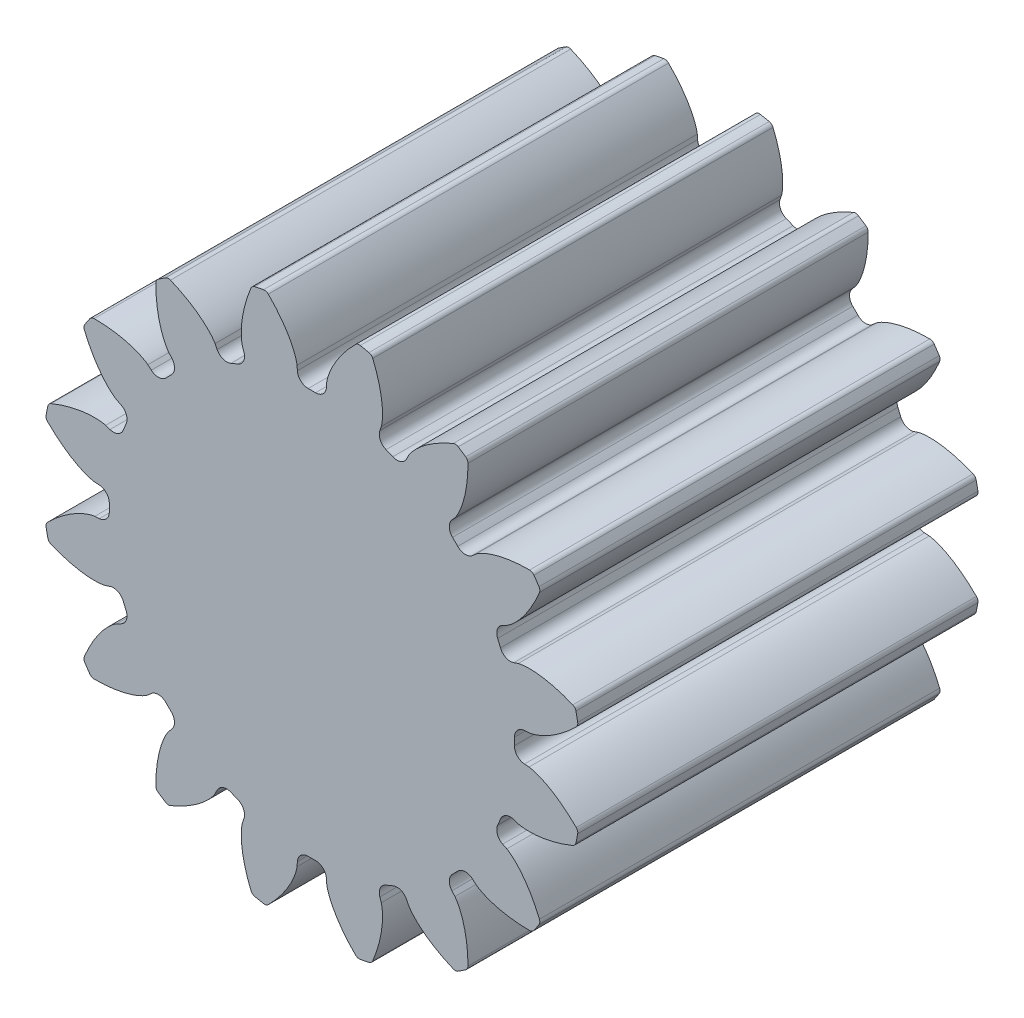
from build123d import *

# Parameters (mm, degrees)
SKETCH1_R                                 = 8.5725
BOSS_EXTRUDE1_DEPTH                       = 12.7
CUT_EXTRUDE_DCLTBC_DEPTH                  = 18.557491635
FILLET_TIP_DCLTBC_R                       = 0.169380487
FILLET_ROOT_DCLTBC_R                      = 0.338760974
CIRPATTERN_DCLTBC_COUNT                   = 16
FILLET_TIP_DCLTBC_OF_CIRPATTERN_DCLTBC_R  = 0.169380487
FILLET_ROOT_DCLTBC_OF_CIRPATTERN_DCLTBC_R = 0.338760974


with BuildPart() as part:
    # Sketch1 → Boss-Extrude1 (new body)
    with BuildSketch(Plane.XY):
        Circle(SKETCH1_R)
    extrude(amount=BOSS_EXTRUDE1_DEPTH)

    # DCLTBC → Cut-Extrude-DCLTBC (cut, through all)
    with BuildSketch(Plane.XY):
        with BuildLine():
            Line((-0.470624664, 6.890010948), (-0.438139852, 6.414428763))
            ThreePointArc((-0.438139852, 6.414428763), (0, 6.429375), (0.438139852, 6.414428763))
            Line((0.438139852, 6.414428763), (0.470624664, 6.890010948))
            add(Edge.make_bspline(
                [(0.470624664, 6.890010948), (0.4708557, 6.892762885), (0.471636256, 6.900469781), (0.473635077, 6.914990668), (0.47763725, 6.938593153), (0.483822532, 6.968514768), (0.493058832, 7.006983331), (0.505530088, 7.052006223), (0.520893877, 7.101140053), (0.539388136, 7.154184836), (0.559403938, 7.206711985), (0.580818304, 7.258717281), (0.603450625, 7.310150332), (0.632390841, 7.371982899), (0.669207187, 7.44545471), (0.71528691, 7.530277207), (0.771120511, 7.625175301), (0.831789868, 7.720393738), (0.894566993, 7.812822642), (0.961475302, 7.904654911), (1.028676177, 7.992398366), (1.101966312, 8.0818259), (1.171399, 8.163509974), (1.252972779, 8.253023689), (1.319916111, 8.324686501), (1.39216911, 8.396974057), (1.427789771, 8.431896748), (1.446184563, 8.44963351)],
                knots=[0, 0, 0, 0, 0, 0.005376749, 0.015083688, 0.02853182, 0.046610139, 0.064854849, 0.092110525, 0.119476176, 0.146842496, 0.174208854, 0.201574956, 0.228941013, 0.256307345, 0.307035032, 0.361767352, 0.416499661, 0.471231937, 0.525964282, 0.580696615, 0.635428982, 0.690161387, 0.744893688, 0.799626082, 0.854358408, 0.909090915, 0.909090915, 0.909090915, 0.909090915, 0.909090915], degree=4))
            ThreePointArc((1.446184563, 8.44963351), (0, 8.5725), (-1.446184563, 8.44963351))
            add(Edge.make_bspline(
                [(-0.470624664, 6.890010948), (-0.4708557, 6.892762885), (-0.471636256, 6.900469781), (-0.473635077, 6.914990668), (-0.47763725, 6.938593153), (-0.483822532, 6.968514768), (-0.493058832, 7.006983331), (-0.505530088, 7.052006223), (-0.520893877, 7.101140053), (-0.539388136, 7.154184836), (-0.559403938, 7.206711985), (-0.580818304, 7.258717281), (-0.603450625, 7.310150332), (-0.632390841, 7.371982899), (-0.669207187, 7.44545471), (-0.71528691, 7.530277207), (-0.771120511, 7.625175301), (-0.831789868, 7.720393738), (-0.894566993, 7.812822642), (-0.961475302, 7.904654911), (-1.028676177, 7.992398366), (-1.101966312, 8.0818259), (-1.171399, 8.163509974), (-1.252972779, 8.253023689), (-1.319916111, 8.324686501), (-1.39216911, 8.396974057), (-1.427789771, 8.431896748), (-1.446184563, 8.44963351)],
                knots=[0, 0, 0, 0, 0, 0.005376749, 0.015083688, 0.02853182, 0.046610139, 0.064854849, 0.092110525, 0.119476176, 0.146842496, 0.174208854, 0.201574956, 0.228941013, 0.256307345, 0.307035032, 0.361767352, 0.416499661, 0.471231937, 0.525964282, 0.580696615, 0.635428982, 0.690161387, 0.744893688, 0.799626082, 0.854358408, 0.909090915, 0.909090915, 0.909090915, 0.909090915, 0.909090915], degree=4))
        make_face()
    cut_extrude_dcltbc = extrude(amount=CUT_EXTRUDE_DCLTBC_DEPTH, mode=Mode.SUBTRACT)

    # Fillet-Tip-DCLTBC
    fillet_tip_dcltbc_edges = [part.edges().sort_by_distance(p)[0] for p in [
        (1.446184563, 8.44963351, 6.35),
        (-1.446184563, 8.44963351, 6.35),
    ]]
    fillet(fillet_tip_dcltbc_edges, radius=FILLET_TIP_DCLTBC_R)

    # Fillet-Root-DCLTBC
    fillet_root_dcltbc_edges = [part.edges().sort_by_distance(p)[0] for p in [
        (0.438139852, 6.414428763, 6.35),
        (-0.438139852, 6.414428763, 6.35),
    ]]
    fillet(fillet_root_dcltbc_edges, radius=FILLET_ROOT_DCLTBC_R)

    # CirPattern-DCLTBC: Cut-Extrude-DCLTBC ×16 about axis
    cirpattern_dcltbc_axis = Axis((0, 0, 12.7), (0, 0, 1))
    for i in range(1, CIRPATTERN_DCLTBC_COUNT):
        add(cut_extrude_dcltbc.rotate(cirpattern_dcltbc_axis, i * 360 / CIRPATTERN_DCLTBC_COUNT), mode=Mode.SUBTRACT)

    # Fillet-Tip-DCLTBC of CirPattern-DCLTBC
    fillet_tip_dcltbc_of_cirpattern_dcltbc_edges = [part.edges().sort_by_distance(p)[0] for p in [
        (-1.897434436, 8.35987433, 6.35),
        (-4.569635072, 7.253012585, 6.35),
        (-4.952186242, 6.997400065, 6.35),
        (-6.997400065, 4.952186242, 6.35),
        (-7.253012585, 4.569635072, 6.35),
        (-8.35987433, 1.897434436, 6.35),
        (-8.44963351, 1.446184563, 6.35),
        (-8.44963351, -1.446184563, 6.35),
        (-8.35987433, -1.897434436, 6.35),
        (-7.253012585, -4.569635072, 6.35),
        (-6.997400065, -4.952186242, 6.35),
        (-4.952186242, -6.997400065, 6.35),
        (-4.569635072, -7.253012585, 6.35),
        (-1.897434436, -8.35987433, 6.35),
        (-1.446184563, -8.44963351, 6.35),
        (1.446184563, -8.44963351, 6.35),
        (1.897434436, -8.35987433, 6.35),
        (4.569635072, -7.253012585, 6.35),
        (4.952186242, -6.997400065, 6.35),
        (6.997400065, -4.952186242, 6.35),
        (7.253012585, -4.569635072, 6.35),
        (8.35987433, -1.897434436, 6.35),
        (8.44963351, -1.446184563, 6.35),
        (8.44963351, 1.446184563, 6.35),
        (8.35987433, 1.897434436, 6.35),
        (7.253012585, 4.569635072, 6.35),
        (6.997400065, 4.952186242, 6.35),
        (4.952186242, 6.997400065, 6.35),
        (4.569635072, 7.253012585, 6.35),
        (1.897434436, 8.35987433, 6.35),
    ]]
    fillet(fillet_tip_dcltbc_of_cirpattern_dcltbc_edges, radius=FILLET_TIP_DCLTBC_OF_CIRPATTERN_DCLTBC_R)

    # Fillet-Root-DCLTBC of CirPattern-DCLTBC
    fillet_root_dcltbc_of_cirpattern_dcltbc_edges = [part.edges().sort_by_distance(p)[0] for p in [
        (-2.049907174, 6.09382831, 6.35),
        (-2.859484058, 5.758490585, 6.35),
        (-4.225874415, 4.845497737, 6.35),
        (-4.845497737, 4.225874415, 6.35),
        (-5.758490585, 2.859484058, 6.35),
        (-6.09382831, 2.049907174, 6.35),
        (-6.414428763, 0.438139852, 6.35),
        (-6.414428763, -0.438139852, 6.35),
        (-6.09382831, -2.049907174, 6.35),
        (-5.758490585, -2.859484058, 6.35),
        (-4.845497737, -4.225874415, 6.35),
        (-4.225874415, -4.845497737, 6.35),
        (-2.859484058, -5.758490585, 6.35),
        (-2.049907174, -6.09382831, 6.35),
        (-0.438139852, -6.414428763, 6.35),
        (0.438139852, -6.414428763, 6.35),
        (2.049907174, -6.09382831, 6.35),
        (2.859484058, -5.758490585, 6.35),
        (4.225874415, -4.845497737, 6.35),
        (4.845497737, -4.225874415, 6.35),
        (5.758490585, -2.859484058, 6.35),
        (6.09382831, -2.049907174, 6.35),
        (6.414428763, -0.438139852, 6.35),
        (6.414428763, 0.438139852, 6.35),
        (6.09382831, 2.049907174, 6.35),
        (5.758490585, 2.859484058, 6.35),
        (4.845497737, 4.225874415, 6.35),
        (4.225874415, 4.845497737, 6.35),
        (2.859484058, 5.758490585, 6.35),
        (2.049907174, 6.09382831, 6.35),
    ]]
    fillet(fillet_root_dcltbc_of_cirpattern_dcltbc_edges, radius=FILLET_ROOT_DCLTBC_OF_CIRPATTERN_DCLTBC_R)


solid = part.part
